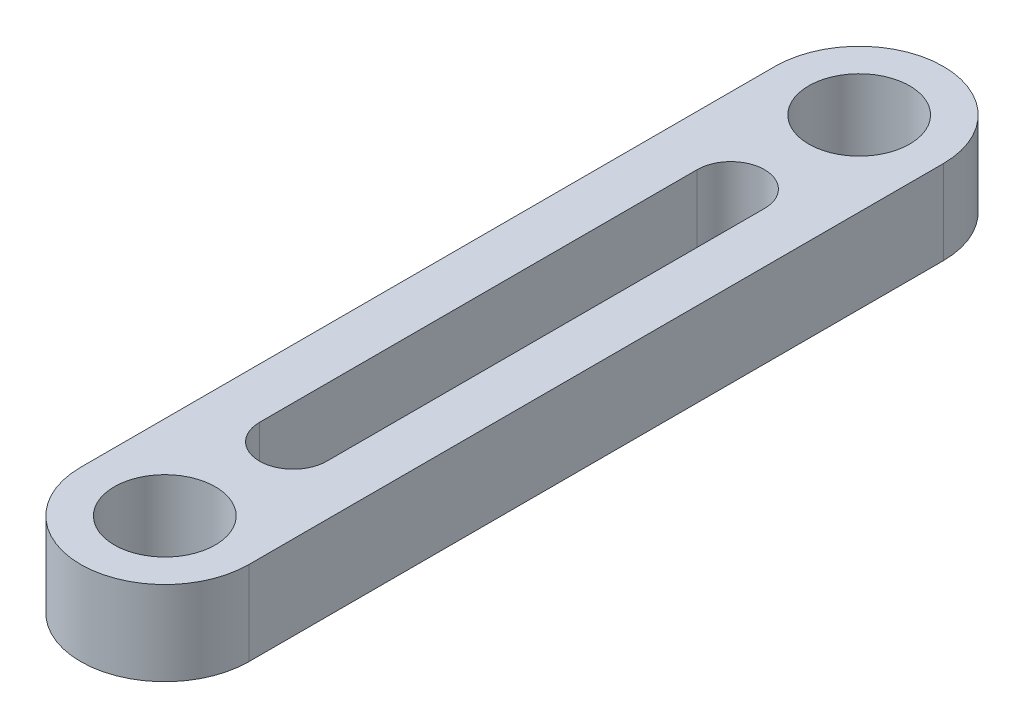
ISO-10303-21;
HEADER;
FILE_DESCRIPTION(('STEP AP214'),'2;1');
FILE_NAME('part.step','',(''),(''),'','','');
FILE_SCHEMA(('AUTOMOTIVE_DESIGN { 1 0 10303 214 1 1 1 1 }'));
ENDSEC;
DATA;
#1=APPLICATION_CONTEXT('core data for automotive mechanical design processes');
#2=APPLICATION_PROTOCOL_DEFINITION('international standard','automotive_design',2000,#1);
#3=PRODUCT_CONTEXT('',#1,'mechanical');
#4=PRODUCT('Part','Part','',(#3));
#5=PRODUCT_RELATED_PRODUCT_CATEGORY('part','',(#4));
#6=PRODUCT_DEFINITION_FORMATION('','',#4);
#7=PRODUCT_DEFINITION_CONTEXT('part definition',#1,'design');
#8=PRODUCT_DEFINITION('design','',#6,#7);
#9=PRODUCT_DEFINITION_SHAPE('','',#8);
#10=(LENGTH_UNIT() NAMED_UNIT(*) SI_UNIT(.MILLI.,.METRE.));
#11=(NAMED_UNIT(*) PLANE_ANGLE_UNIT() SI_UNIT($,.RADIAN.));
#12=(NAMED_UNIT(*) SI_UNIT($,.STERADIAN.) SOLID_ANGLE_UNIT());
#13=UNCERTAINTY_MEASURE_WITH_UNIT(LENGTH_MEASURE(1.E-05),#10,'distance_accuracy_value','');
#14=(GEOMETRIC_REPRESENTATION_CONTEXT(3) GLOBAL_UNCERTAINTY_ASSIGNED_CONTEXT((#13)) GLOBAL_UNIT_ASSIGNED_CONTEXT((#10,
#11,#12)) REPRESENTATION_CONTEXT('',''));
#15=CARTESIAN_POINT('',(0.,0.,0.));
#16=DIRECTION('',(0.,0.,1.));
#17=DIRECTION('',(1.,0.,0.));
#18=AXIS2_PLACEMENT_3D('',#15,#16,#17);
#19=CARTESIAN_POINT('',(-8.62326278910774,-10.,0.));
#20=DIRECTION('',(-1.,0.,0.));
#21=DIRECTION('',(0.,0.,1.));
#22=AXIS2_PLACEMENT_3D('',#19,#20,#21);
#23=PLANE('',#22);
#24=DIRECTION('',(0.,0.,1.));
#25=VECTOR('',#24,1.);
#26=CARTESIAN_POINT('',(-8.62326278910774,0.,0.));
#27=LINE('',#26,#25);
#28=CARTESIAN_POINT('',(-8.62326278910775,0.,-41.25));
#29=VERTEX_POINT('',#28);
#30=CARTESIAN_POINT('',(-8.62326278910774,0.,41.25));
#31=VERTEX_POINT('',#30);
#32=EDGE_CURVE('E160',#29,#31,#27,.T.);
#33=ORIENTED_EDGE('',*,*,#32,.F.);
#34=DIRECTION('',(0.,1.,0.));
#35=VECTOR('',#34,1.);
#36=CARTESIAN_POINT('',(-8.62326278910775,-10.,-41.25));
#37=LINE('',#36,#35);
#38=CARTESIAN_POINT('',(-8.62326278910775,-10.,-41.25));
#39=VERTEX_POINT('',#38);
#40=EDGE_CURVE('E11',#39,#29,#37,.T.);
#41=ORIENTED_EDGE('',*,*,#40,.F.);
#42=DIRECTION('',(0.,0.,1.));
#43=VECTOR('',#42,1.);
#44=CARTESIAN_POINT('',(-8.62326278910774,-10.,0.));
#45=LINE('',#44,#43);
#46=CARTESIAN_POINT('',(-8.62326278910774,-10.,41.25));
#47=VERTEX_POINT('',#46);
#48=EDGE_CURVE('E144',#39,#47,#45,.T.);
#49=ORIENTED_EDGE('',*,*,#48,.T.);
#50=DIRECTION('',(0.,1.,0.));
#51=VECTOR('',#50,1.);
#52=CARTESIAN_POINT('',(-8.62326278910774,-10.,41.25));
#53=LINE('',#52,#51);
#54=EDGE_CURVE('E38',#47,#31,#53,.T.);
#55=ORIENTED_EDGE('',*,*,#54,.T.);
#56=EDGE_LOOP('',(#33,#41,#49,#55));
#57=FACE_BOUND('',#56,.T.);
#58=ADVANCED_FACE('F34',(#57),#23,.T.);
#59=CARTESIAN_POINT('',(1.37673721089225,-10.,-41.25));
#60=DIRECTION('',(0.,1.,0.));
#61=DIRECTION('',(0.,0.,1.));
#62=AXIS2_PLACEMENT_3D('',#59,#60,#61);
#63=CYLINDRICAL_SURFACE('',#62,10.);
#64=CARTESIAN_POINT('',(1.37673721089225,0.,-41.25));
#65=DIRECTION('',(0.,1.,0.));
#66=DIRECTION('',(0.,0.,1.));
#67=AXIS2_PLACEMENT_3D('',#64,#65,#66);
#68=CIRCLE('',#67,10.);
#69=CARTESIAN_POINT('',(11.3767372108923,0.,-41.25));
#70=VERTEX_POINT('',#69);
#71=EDGE_CURVE('E141',#70,#29,#68,.T.);
#72=ORIENTED_EDGE('',*,*,#71,.F.);
#73=DIRECTION('',(0.,1.,0.));
#74=VECTOR('',#73,1.);
#75=CARTESIAN_POINT('',(11.3767372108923,-10.,-41.25));
#76=LINE('',#75,#74);
#77=CARTESIAN_POINT('',(11.3767372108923,-10.,-41.25));
#78=VERTEX_POINT('',#77);
#79=EDGE_CURVE('E43',#78,#70,#76,.T.);
#80=ORIENTED_EDGE('',*,*,#79,.F.);
#81=CARTESIAN_POINT('',(1.37673721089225,-10.,-41.25));
#82=DIRECTION('',(0.,1.,0.));
#83=DIRECTION('',(0.,0.,1.));
#84=AXIS2_PLACEMENT_3D('',#81,#82,#83);
#85=CIRCLE('',#84,10.);
#86=EDGE_CURVE('E152',#78,#39,#85,.T.);
#87=ORIENTED_EDGE('',*,*,#86,.T.);
#88=ORIENTED_EDGE('',*,*,#40,.T.);
#89=EDGE_LOOP('',(#72,#80,#87,#88));
#90=FACE_BOUND('',#89,.T.);
#91=ADVANCED_FACE('F185',(#90),#63,.T.);
#92=CARTESIAN_POINT('',(11.3767372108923,-10.,0.));
#93=DIRECTION('',(-1.,0.,0.));
#94=DIRECTION('',(0.,0.,1.));
#95=AXIS2_PLACEMENT_3D('',#92,#93,#94);
#96=PLANE('',#95);
#97=DIRECTION('',(0.,0.,1.));
#98=VECTOR('',#97,1.);
#99=CARTESIAN_POINT('',(11.3767372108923,0.,0.));
#100=LINE('',#99,#98);
#101=CARTESIAN_POINT('',(11.3767372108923,0.,41.25));
#102=VERTEX_POINT('',#101);
#103=EDGE_CURVE('E166',#70,#102,#100,.T.);
#104=ORIENTED_EDGE('',*,*,#103,.T.);
#105=DIRECTION('',(0.,1.,0.));
#106=VECTOR('',#105,1.);
#107=CARTESIAN_POINT('',(11.3767372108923,-10.,41.25));
#108=LINE('',#107,#106);
#109=CARTESIAN_POINT('',(11.3767372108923,-10.,41.25));
#110=VERTEX_POINT('',#109);
#111=EDGE_CURVE('E171',#110,#102,#108,.T.);
#112=ORIENTED_EDGE('',*,*,#111,.F.);
#113=DIRECTION('',(0.,0.,1.));
#114=VECTOR('',#113,1.);
#115=CARTESIAN_POINT('',(11.3767372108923,-10.,0.));
#116=LINE('',#115,#114);
#117=EDGE_CURVE('E150',#78,#110,#116,.T.);
#118=ORIENTED_EDGE('',*,*,#117,.F.);
#119=ORIENTED_EDGE('',*,*,#79,.T.);
#120=EDGE_LOOP('',(#104,#112,#118,#119));
#121=FACE_BOUND('',#120,.T.);
#122=ADVANCED_FACE('F190',(#121),#96,.F.);
#123=CARTESIAN_POINT('',(1.37673721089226,-10.,41.25));
#124=DIRECTION('',(0.,1.,0.));
#125=DIRECTION('',(0.,0.,1.));
#126=AXIS2_PLACEMENT_3D('',#123,#124,#125);
#127=CYLINDRICAL_SURFACE('',#126,6.);
#128=CARTESIAN_POINT('',(1.37673721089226,-10.,41.25));
#129=DIRECTION('',(0.,1.,0.));
#130=DIRECTION('',(0.,0.,1.));
#131=AXIS2_PLACEMENT_3D('',#128,#129,#130);
#132=CIRCLE('',#131,6.);
#133=CARTESIAN_POINT('',(1.37673721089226,-10.,47.25));
#134=VERTEX_POINT('',#133);
#135=EDGE_CURVE('E140',#134,#134,#132,.T.);
#136=ORIENTED_EDGE('',*,*,#135,.F.);
#137=EDGE_LOOP('',(#136));
#138=FACE_BOUND('',#137,.T.);
#139=CARTESIAN_POINT('',(1.37673721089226,0.,41.25));
#140=DIRECTION('',(0.,1.,0.));
#141=DIRECTION('',(0.,0.,1.));
#142=AXIS2_PLACEMENT_3D('',#139,#140,#141);
#143=CIRCLE('',#142,6.);
#144=CARTESIAN_POINT('',(1.37673721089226,0.,47.25));
#145=VERTEX_POINT('',#144);
#146=EDGE_CURVE('E157',#145,#145,#143,.T.);
#147=ORIENTED_EDGE('',*,*,#146,.T.);
#148=EDGE_LOOP('',(#147));
#149=FACE_BOUND('',#148,.T.);
#150=ADVANCED_FACE('F192',(#138,#149),#127,.F.);
#151=CARTESIAN_POINT('',(1.37673721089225,-10.,-41.25));
#152=DIRECTION('',(0.,1.,0.));
#153=DIRECTION('',(0.,0.,1.));
#154=AXIS2_PLACEMENT_3D('',#151,#152,#153);
#155=CYLINDRICAL_SURFACE('',#154,6.);
#156=CARTESIAN_POINT('',(1.37673721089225,-10.,-41.25));
#157=DIRECTION('',(0.,1.,0.));
#158=DIRECTION('',(0.,0.,1.));
#159=AXIS2_PLACEMENT_3D('',#156,#157,#158);
#160=CIRCLE('',#159,6.);
#161=CARTESIAN_POINT('',(1.37673721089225,-10.,-35.25));
#162=VERTEX_POINT('',#161);
#163=EDGE_CURVE('E137',#162,#162,#160,.T.);
#164=ORIENTED_EDGE('',*,*,#163,.F.);
#165=EDGE_LOOP('',(#164));
#166=FACE_BOUND('',#165,.T.);
#167=CARTESIAN_POINT('',(1.37673721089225,0.,-41.25));
#168=DIRECTION('',(0.,1.,0.));
#169=DIRECTION('',(0.,0.,1.));
#170=AXIS2_PLACEMENT_3D('',#167,#168,#169);
#171=CIRCLE('',#170,6.);
#172=CARTESIAN_POINT('',(1.37673721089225,0.,-35.25));
#173=VERTEX_POINT('',#172);
#174=EDGE_CURVE('E133',#173,#173,#171,.T.);
#175=ORIENTED_EDGE('',*,*,#174,.T.);
#176=EDGE_LOOP('',(#175));
#177=FACE_BOUND('',#176,.T.);
#178=ADVANCED_FACE('F36',(#166,#177),#155,.F.);
#179=CARTESIAN_POINT('',(1.37673721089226,-10.,41.25));
#180=DIRECTION('',(0.,1.,0.));
#181=DIRECTION('',(0.,0.,1.));
#182=AXIS2_PLACEMENT_3D('',#179,#180,#181);
#183=CYLINDRICAL_SURFACE('',#182,10.);
#184=CARTESIAN_POINT('',(1.37673721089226,0.,41.25));
#185=DIRECTION('',(0.,1.,0.));
#186=DIRECTION('',(0.,0.,1.));
#187=AXIS2_PLACEMENT_3D('',#184,#185,#186);
#188=CIRCLE('',#187,10.);
#189=EDGE_CURVE('E163',#31,#102,#188,.T.);
#190=ORIENTED_EDGE('',*,*,#189,.F.);
#191=ORIENTED_EDGE('',*,*,#54,.F.);
#192=CARTESIAN_POINT('',(1.37673721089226,-10.,41.25));
#193=DIRECTION('',(0.,1.,0.));
#194=DIRECTION('',(0.,0.,1.));
#195=AXIS2_PLACEMENT_3D('',#192,#193,#194);
#196=CIRCLE('',#195,10.);
#197=EDGE_CURVE('E147',#47,#110,#196,.T.);
#198=ORIENTED_EDGE('',*,*,#197,.T.);
#199=ORIENTED_EDGE('',*,*,#111,.T.);
#200=EDGE_LOOP('',(#190,#191,#198,#199));
#201=FACE_BOUND('',#200,.T.);
#202=ADVANCED_FACE('F179',(#201),#183,.T.);
#203=CARTESIAN_POINT('',(-79.9944893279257,-10.,0.));
#204=DIRECTION('',(0.,1.,0.));
#205=DIRECTION('',(0.,0.,1.));
#206=AXIS2_PLACEMENT_3D('',#203,#204,#205);
#207=PLANE('',#206);
#208=DIRECTION('',(0.,0.,-1.));
#209=VECTOR('',#208,1.);
#210=CARTESIAN_POINT('',(5.37673721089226,-10.,-26.));
#211=LINE('',#210,#209);
#212=CARTESIAN_POINT('',(5.37673721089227,-10.,26.));
#213=VERTEX_POINT('',#212);
#214=CARTESIAN_POINT('',(5.37673721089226,-10.,-26.));
#215=VERTEX_POINT('',#214);
#216=EDGE_CURVE('E108',#213,#215,#211,.T.);
#217=ORIENTED_EDGE('',*,*,#216,.T.);
#218=CARTESIAN_POINT('',(1.37673721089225,-10.,-26.));
#219=DIRECTION('',(0.,1.,0.));
#220=DIRECTION('',(0.,0.,1.));
#221=AXIS2_PLACEMENT_3D('',#218,#219,#220);
#222=CIRCLE('',#221,4.);
#223=CARTESIAN_POINT('',(-2.62326278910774,-10.,-26.));
#224=VERTEX_POINT('',#223);
#225=EDGE_CURVE('E102',#215,#224,#222,.T.);
#226=ORIENTED_EDGE('',*,*,#225,.T.);
#227=DIRECTION('',(0.,0.,1.));
#228=VECTOR('',#227,1.);
#229=CARTESIAN_POINT('',(-2.62326278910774,-10.,-26.));
#230=LINE('',#229,#228);
#231=CARTESIAN_POINT('',(-2.62326278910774,-10.,26.));
#232=VERTEX_POINT('',#231);
#233=EDGE_CURVE('E111',#224,#232,#230,.T.);
#234=ORIENTED_EDGE('',*,*,#233,.T.);
#235=CARTESIAN_POINT('',(1.37673721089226,-10.,26.));
#236=DIRECTION('',(0.,1.,0.));
#237=DIRECTION('',(0.,0.,1.));
#238=AXIS2_PLACEMENT_3D('',#235,#236,#237);
#239=CIRCLE('',#238,4.);
#240=EDGE_CURVE('E51',#232,#213,#239,.T.);
#241=ORIENTED_EDGE('',*,*,#240,.T.);
#242=EDGE_LOOP('',(#217,#226,#234,#241));
#243=FACE_BOUND('',#242,.T.);
#244=ORIENTED_EDGE('',*,*,#163,.T.);
#245=EDGE_LOOP('',(#244));
#246=FACE_BOUND('',#245,.T.);
#247=ORIENTED_EDGE('',*,*,#135,.T.);
#248=EDGE_LOOP('',(#247));
#249=FACE_BOUND('',#248,.T.);
#250=ORIENTED_EDGE('',*,*,#48,.F.);
#251=ORIENTED_EDGE('',*,*,#86,.F.);
#252=ORIENTED_EDGE('',*,*,#117,.T.);
#253=ORIENTED_EDGE('',*,*,#197,.F.);
#254=EDGE_LOOP('',(#250,#251,#252,#253));
#255=FACE_BOUND('',#254,.T.);
#256=ADVANCED_FACE('F115',(#243,#246,#249,#255),#207,.F.);
#257=CARTESIAN_POINT('',(-79.9944893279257,0.,0.));
#258=DIRECTION('',(0.,1.,0.));
#259=DIRECTION('',(0.,0.,1.));
#260=AXIS2_PLACEMENT_3D('',#257,#258,#259);
#261=PLANE('',#260);
#262=CARTESIAN_POINT('',(1.37673721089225,0.,-26.));
#263=DIRECTION('',(0.,1.,0.));
#264=DIRECTION('',(0.,0.,1.));
#265=AXIS2_PLACEMENT_3D('',#262,#263,#264);
#266=CIRCLE('',#265,4.);
#267=CARTESIAN_POINT('',(5.37673721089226,0.,-26.));
#268=VERTEX_POINT('',#267);
#269=CARTESIAN_POINT('',(-2.62326278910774,0.,-26.));
#270=VERTEX_POINT('',#269);
#271=EDGE_CURVE('E59',#268,#270,#266,.T.);
#272=ORIENTED_EDGE('',*,*,#271,.F.);
#273=DIRECTION('',(0.,0.,-1.));
#274=VECTOR('',#273,1.);
#275=CARTESIAN_POINT('',(5.37673721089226,0.,-26.));
#276=LINE('',#275,#274);
#277=CARTESIAN_POINT('',(5.37673721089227,0.,26.));
#278=VERTEX_POINT('',#277);
#279=EDGE_CURVE('E118',#278,#268,#276,.T.);
#280=ORIENTED_EDGE('',*,*,#279,.F.);
#281=CARTESIAN_POINT('',(1.37673721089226,0.,26.));
#282=DIRECTION('',(0.,1.,0.));
#283=DIRECTION('',(0.,0.,1.));
#284=AXIS2_PLACEMENT_3D('',#281,#282,#283);
#285=CIRCLE('',#284,4.);
#286=CARTESIAN_POINT('',(-2.62326278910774,0.,26.));
#287=VERTEX_POINT('',#286);
#288=EDGE_CURVE('E121',#287,#278,#285,.T.);
#289=ORIENTED_EDGE('',*,*,#288,.F.);
#290=DIRECTION('',(0.,0.,1.));
#291=VECTOR('',#290,1.);
#292=CARTESIAN_POINT('',(-2.62326278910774,0.,-26.));
#293=LINE('',#292,#291);
#294=EDGE_CURVE('E127',#270,#287,#293,.T.);
#295=ORIENTED_EDGE('',*,*,#294,.F.);
#296=EDGE_LOOP('',(#272,#280,#289,#295));
#297=FACE_BOUND('',#296,.T.);
#298=ORIENTED_EDGE('',*,*,#174,.F.);
#299=EDGE_LOOP('',(#298));
#300=FACE_BOUND('',#299,.T.);
#301=ORIENTED_EDGE('',*,*,#146,.F.);
#302=EDGE_LOOP('',(#301));
#303=FACE_BOUND('',#302,.T.);
#304=ORIENTED_EDGE('',*,*,#32,.T.);
#305=ORIENTED_EDGE('',*,*,#189,.T.);
#306=ORIENTED_EDGE('',*,*,#103,.F.);
#307=ORIENTED_EDGE('',*,*,#71,.T.);
#308=EDGE_LOOP('',(#304,#305,#306,#307));
#309=FACE_BOUND('',#308,.T.);
#310=ADVANCED_FACE('F182',(#297,#300,#303,#309),#261,.T.);
#311=CARTESIAN_POINT('',(1.37673721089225,-10.,-26.));
#312=DIRECTION('',(0.,1.,0.));
#313=DIRECTION('',(0.,0.,1.));
#314=AXIS2_PLACEMENT_3D('',#311,#312,#313);
#315=CYLINDRICAL_SURFACE('',#314,4.);
#316=ORIENTED_EDGE('',*,*,#271,.T.);
#317=DIRECTION('',(0.,1.,0.));
#318=VECTOR('',#317,1.);
#319=CARTESIAN_POINT('',(-2.62326278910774,-10.,-26.));
#320=LINE('',#319,#318);
#321=EDGE_CURVE('E98',#224,#270,#320,.T.);
#322=ORIENTED_EDGE('',*,*,#321,.F.);
#323=ORIENTED_EDGE('',*,*,#225,.F.);
#324=DIRECTION('',(0.,1.,0.));
#325=VECTOR('',#324,1.);
#326=CARTESIAN_POINT('',(5.37673721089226,-10.,-26.));
#327=LINE('',#326,#325);
#328=EDGE_CURVE('E131',#215,#268,#327,.T.);
#329=ORIENTED_EDGE('',*,*,#328,.T.);
#330=EDGE_LOOP('',(#316,#322,#323,#329));
#331=FACE_BOUND('',#330,.T.);
#332=ADVANCED_FACE('F100',(#331),#315,.F.);
#333=CARTESIAN_POINT('',(5.37673721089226,-10.,-26.));
#334=DIRECTION('',(1.,0.,0.));
#335=DIRECTION('',(0.,0.,-1.));
#336=AXIS2_PLACEMENT_3D('',#333,#334,#335);
#337=PLANE('',#336);
#338=ORIENTED_EDGE('',*,*,#279,.T.);
#339=ORIENTED_EDGE('',*,*,#328,.F.);
#340=ORIENTED_EDGE('',*,*,#216,.F.);
#341=DIRECTION('',(0.,1.,0.));
#342=VECTOR('',#341,1.);
#343=CARTESIAN_POINT('',(5.37673721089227,-10.,26.));
#344=LINE('',#343,#342);
#345=EDGE_CURVE('E134',#213,#278,#344,.T.);
#346=ORIENTED_EDGE('',*,*,#345,.T.);
#347=EDGE_LOOP('',(#338,#339,#340,#346));
#348=FACE_BOUND('',#347,.T.);
#349=ADVANCED_FACE('F227',(#348),#337,.F.);
#350=CARTESIAN_POINT('',(1.37673721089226,-10.,26.));
#351=DIRECTION('',(0.,1.,0.));
#352=DIRECTION('',(0.,0.,1.));
#353=AXIS2_PLACEMENT_3D('',#350,#351,#352);
#354=CYLINDRICAL_SURFACE('',#353,4.);
#355=ORIENTED_EDGE('',*,*,#288,.T.);
#356=ORIENTED_EDGE('',*,*,#345,.F.);
#357=ORIENTED_EDGE('',*,*,#240,.F.);
#358=DIRECTION('',(0.,1.,0.));
#359=VECTOR('',#358,1.);
#360=CARTESIAN_POINT('',(-2.62326278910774,-10.,26.));
#361=LINE('',#360,#359);
#362=EDGE_CURVE('E107',#232,#287,#361,.T.);
#363=ORIENTED_EDGE('',*,*,#362,.T.);
#364=EDGE_LOOP('',(#355,#356,#357,#363));
#365=FACE_BOUND('',#364,.T.);
#366=ADVANCED_FACE('F232',(#365),#354,.F.);
#367=CARTESIAN_POINT('',(-2.62326278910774,-10.,-26.));
#368=DIRECTION('',(-1.,0.,0.));
#369=DIRECTION('',(0.,0.,1.));
#370=AXIS2_PLACEMENT_3D('',#367,#368,#369);
#371=PLANE('',#370);
#372=ORIENTED_EDGE('',*,*,#294,.T.);
#373=ORIENTED_EDGE('',*,*,#362,.F.);
#374=ORIENTED_EDGE('',*,*,#233,.F.);
#375=ORIENTED_EDGE('',*,*,#321,.T.);
#376=EDGE_LOOP('',(#372,#373,#374,#375));
#377=FACE_BOUND('',#376,.T.);
#378=ADVANCED_FACE('F112',(#377),#371,.F.);
#379=CLOSED_SHELL('',(#58,#91,#122,#150,#178,#202,#256,#310,#332,#349,#366,#378));
#380=MANIFOLD_SOLID_BREP('B2',#379);
#381=ADVANCED_BREP_SHAPE_REPRESENTATION('',(#18,#380),#14);
#382=SHAPE_DEFINITION_REPRESENTATION(#9,#381);
ENDSEC;
END-ISO-10303-21;
